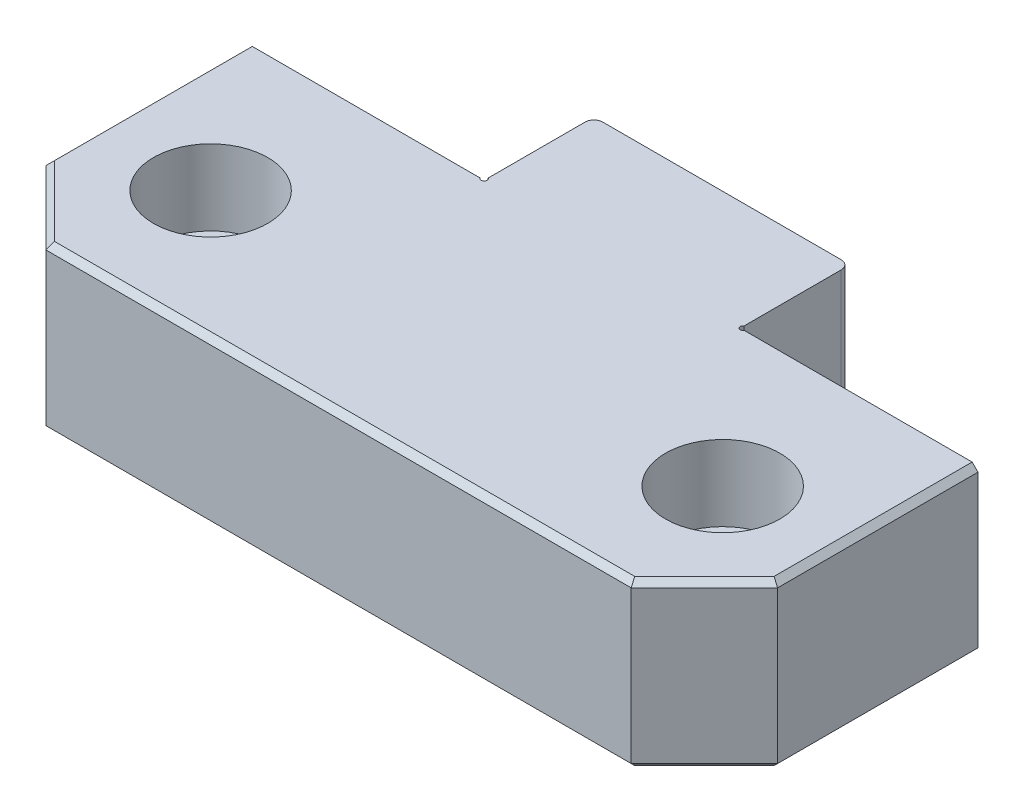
from build123d import *

# Parameters (mm, degrees)
EXTRUDE1_DEPTH     = 28.448
CHAMFER1_SIZE      = 12.7
SKETCH4_R          = 6.7437
CUT_EXTRUDE2_DEPTH = 15.748
CUT_EXTRUDE3_START = -28.448
SKETCH5_R          = 9.9187
CUT_EXTRUDE3_DEPTH = 13.1064
FILLET2_R          = 1.524
CHAMFER3_SIZE      = 1.016
SKETCH6_W          = 44.45
SKETCH6_H          = 19.05
EXTRUDE2_DEPTH     = 0.254


with BuildPart() as part:
    # Sketch2 → Extrude1 (new body)
    with BuildSketch(Plane(origin=(0, 0, 0), x_dir=(1, 0, 0), z_dir=(0, 1, 0))):
        with BuildLine():
            Line((-22.225, 0.693940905), (-22.225, 19.05))
            Line((-22.225, 19.05), (22.225, 19.05))
            Line((22.225, 19.05), (22.225, 0.686191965))
            ThreePointArc((22.225, 0.686191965), (22.124524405, -0.100475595), (22.911191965, 0))
            Line((22.911191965, 0), (63.5, 0))
            Line((63.5, 0), (63.5, -47.498))
            Line((63.5, -47.498), (-63.5, -47.498))
            Line((-63.5, -47.498), (-63.5, 0))
            Line((-63.5, 0), (-22.918940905, 0))
            ThreePointArc((-22.918940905, 0), (-22.119789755, -0.105210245), (-22.225, 0.693940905))
        make_face()
    extrude(amount=EXTRUDE1_DEPTH)

    # Chamfer1
    chamfer1_edges = [part.edges().sort_by_distance(p)[0] for p in [
        (63.5, 14.224, 47.498),
        (-63.5, 14.224, 47.498),
    ]]
    chamfer(chamfer1_edges, length=CHAMFER1_SIZE)

    # Sketch4 → Cut-Extrude2 (cut)
    with BuildSketch(Plane.XZ):
        with Locations(Location((44.45, 25.273, 0), (0, 0, 270))):
            Circle(SKETCH4_R)
        with Locations(Location((-44.45, 25.273, 0), (0, 0, 270))):
            Circle(SKETCH4_R)
    extrude(amount=-CUT_EXTRUDE2_DEPTH, mode=Mode.SUBTRACT)

    # Sketch5 → Cut-Extrude3 (cut)
    with BuildSketch(Plane.XZ.offset(CUT_EXTRUDE3_START)):
        with Locations(Location((44.45, 25.273, 0), (0, 0, 90))):
            Circle(SKETCH5_R)
        with Locations(Location((-44.45, 25.273, 0), (0, 0, 90))):
            Circle(SKETCH5_R)
    extrude(amount=CUT_EXTRUDE3_DEPTH, mode=Mode.SUBTRACT)

    # Fillet2
    fillet2_edges = [part.edges().sort_by_distance(p)[0] for p in [
        (-22.225, 14.224, -19.05),
        (22.225, 14.224, -19.05),
    ]]
    fillet(fillet2_edges, radius=FILLET2_R)

    # Chamfer3
    chamfer3_edges = [part.edges().sort_by_distance(p)[0] for p in [
        (-63.5, 0, 17.399),
        (63.5, 0, 17.399),
        (63.5, 28.448, 17.399),
        (0, 0, 47.498),
        (-57.15, 0, 41.148),
        (57.15, 0, 41.148),
        (0, 28.448, 47.498),
        (-57.15, 28.448, 41.148),
        (57.15, 28.448, 41.148),
        (-63.5, 28.448, 17.399),
    ]]
    chamfer(chamfer3_edges, length=CHAMFER3_SIZE)

    # Sketch6 → Extrude2 (cut)
    with BuildSketch(Plane.XZ):
        with Locations((0, -9.525)):
            Rectangle(SKETCH6_W, SKETCH6_H)
    extrude(amount=-EXTRUDE2_DEPTH, mode=Mode.SUBTRACT)


solid = part.part
